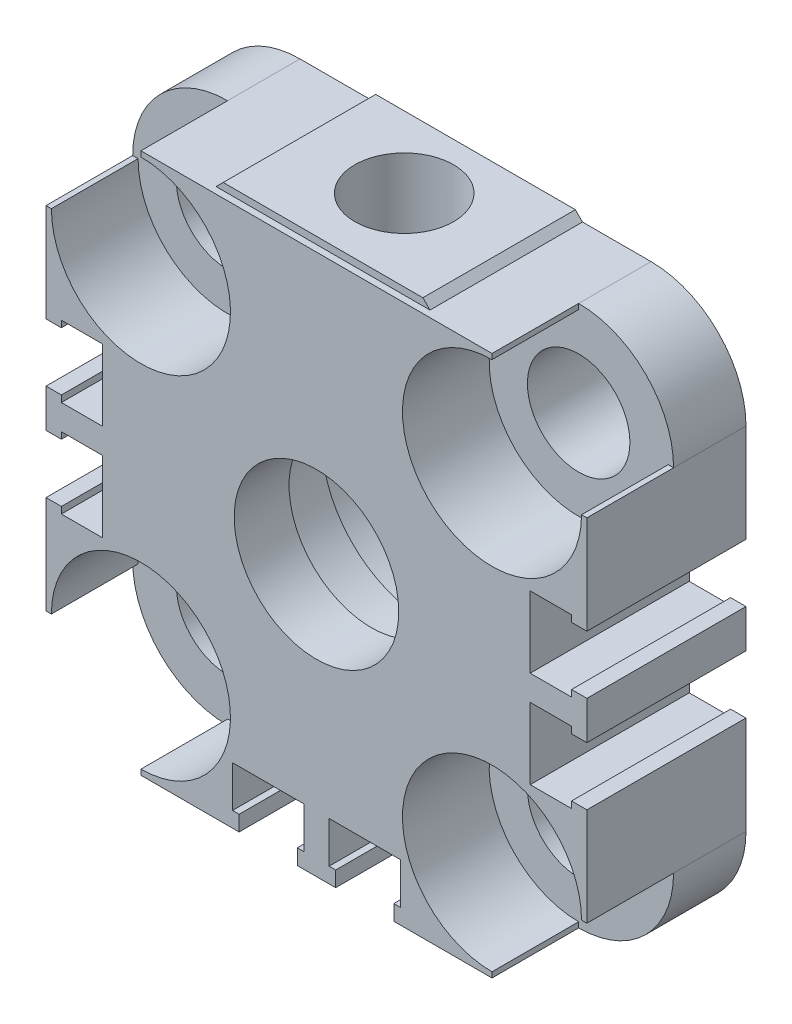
from build123d import *

# Parameters (mm, degrees)
EXTRUSION1_DEPTH                    = 14.5
ENL_V_MAT_EXTRU_1_DEPTH             = 7.9
ESQUISSE3_R                         = 4.67
ENL_V_MAT_EXTRU_2_DEPTH             = 7.9
R_P_TITION_CIRCULAIRE1_COUNT        = 4
ESQUISSE4_R                         = 7.5
ENL_V_MAT_EXTRU_3_DEPTH             = 38.755728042
ENL_V_MAT_EXTRU_4_DEPTH             = 38.755728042
R_P_TITION_CIRCULAIRE2_COUNT        = 3
R_P_TITION_CIRCULAIRE2_ANGLE        = 180
R_P_TITION_CIRCULAIRE2_COPY_1_DEPTH = 38.755728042
R_P_TITION_CIRCULAIRE2_COPY_2_DEPTH = 38.755728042
ESQUISSE7_W                         = 0.5
ESQUISSE7_H                         = 16
ESQUISSE9_W                         = 5
ESQUISSE9_H                         = 10.4
ESQUISSE9_W_2                       = 0.7
ESQUISSE9_H_2                       = 1.25
EXTRUSION2_DEPTH                    = 13.9
TROU_TARAUD_M10X1_01_D              = 9
TROU_TARAUD_M10X1_01_DEPTH          = 13
TROU_TARAUD_M10X1_01_TIP            = 2.703872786
ENL_V_MAT_EXTRU_5_REACH             = 40.183
ENL_V_MAT_EXTRU_5_END_RADIUS        = 4.5
ESQUISSE14_R                        = 0.85
ENL_V_MAT_EXTRU_5_DIRECTION_2_DEPTH = 39.183275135
ESQUISSE15_R                        = 9.5
ENL_V_MAT_EXTRU_6_DEPTH             = 10


with BuildPart() as part:
    # Esquisse1 → Extrusion1 (new body)
    with BuildSketch(Plane.XY):
        with BuildLine():
            Line((-16, 24.65), (16, 24.65))
            ThreePointArc((16, 24.65), (22.116473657, 22.116473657), (24.65, 16))
            Line((24.65, 16), (24.65, -16))
            ThreePointArc((24.65, -16), (22.116473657, -22.116473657), (16, -24.65))
            Line((16, -24.65), (-16, -24.65))
            ThreePointArc((-16, -24.65), (-22.116473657, -22.116473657), (-24.65, -16))
            Line((-24.65, -16), (-24.65, 16))
            ThreePointArc((-24.65, 16), (-22.116473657, 22.116473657), (-16, 24.65))
        make_face()
    extrude(amount=-EXTRUSION1_DEPTH)

    # Esquisse2 → Enl_v. mat.-Extru.1 (cut)
    with BuildSketch(Plane.XY):
        with BuildLine():
            Line((-16, 24.16), (-16, 24.65))
            ThreePointArc((-16, 24.65), (-22.116473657, 22.116473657), (-24.65, 16))
            Line((-24.65, 16), (-24.16, 16))
            ThreePointArc((-24.16, 16), (-10.230008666, 10.230008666), (-16, 24.16))
        make_face()
    enl_v_mat_extru_1 = extrude(amount=-ENL_V_MAT_EXTRU_1_DEPTH, mode=Mode.SUBTRACT)

    # Esquisse3 → Enl_v. mat.-Extru.2 (cut)
    with BuildSketch(Plane.XY.offset(-7.9)):
        with Locations((-16, 16)):
            Circle(ESQUISSE3_R)
    enl_v_mat_extru_2 = extrude(amount=-ENL_V_MAT_EXTRU_2_DEPTH, mode=Mode.SUBTRACT)

    # R_p_tition circulaire1: Enl_v. mat.-Extru.1, Enl_v. mat.-Extru.2 ×4 about axis
    r_p_tition_circulaire1_axis = Axis((0, 0, 0), (0, 0, 1))
    add([enl_v_mat_extru_1.rotate(r_p_tition_circulaire1_axis, i * 360 / R_P_TITION_CIRCULAIRE1_COUNT) for i in range(1, R_P_TITION_CIRCULAIRE1_COUNT)], mode=Mode.SUBTRACT)
    add([enl_v_mat_extru_2.rotate(r_p_tition_circulaire1_axis, i * 360 / R_P_TITION_CIRCULAIRE1_COUNT) for i in range(1, R_P_TITION_CIRCULAIRE1_COUNT)], mode=Mode.SUBTRACT)

    # Esquisse4 → Enl_v. mat.-Extru.3 (cut, through all)
    with BuildSketch(Plane.XY):
        Circle(ESQUISSE4_R)
    extrude(amount=-ENL_V_MAT_EXTRU_3_DEPTH, mode=Mode.SUBTRACT)

    # Esquisse6 → Enl_v. mat.-Extru.4 (cut, through all)
    with BuildSketch(Plane.XY):
        Polygon((-24.65, 7.05), (-23.25, 7.05), (-23.25, 7.65), (-19.48, 7.65), (-19.48, 1.15), (-23.25, 1.15), (-23.25, 1.75), (-24.65, 1.75), align=None)
    enl_v_mat_extru_4 = extrude(amount=-ENL_V_MAT_EXTRU_4_DEPTH, mode=Mode.SUBTRACT)

    # Sym_trie1: Enl_v. mat.-Extru.4 across plane
    add(enl_v_mat_extru_4.mirror(Plane.ZX), mode=Mode.SUBTRACT)

    # R_p_tition circulaire2: Enl_v. mat.-Extru.4 ×3 about axis
    r_p_tition_circulaire2_axis = Axis((0, 0, 0), (0, 0, 1))
    for i in range(1, R_P_TITION_CIRCULAIRE2_COUNT):
        add(enl_v_mat_extru_4.rotate(r_p_tition_circulaire2_axis, i * R_P_TITION_CIRCULAIRE2_ANGLE / (R_P_TITION_CIRCULAIRE2_COUNT - 1)), mode=Mode.SUBTRACT)

    # R_p_tition circulaire2 copy 1 sketch → R_p_tition circulaire2 copy 1 (cut, through all)
    with BuildSketch(Plane(origin=(0, 0, 0), x_dir=(0, 1, 0), z_dir=(0, 0, 1))):
        Polygon((-24.65, -7.05), (-23.25, -7.05), (-23.25, -7.65), (-19.48, -7.65), (-19.48, -1.15), (-23.25, -1.15), (-23.25, -1.75), (-24.65, -1.75), align=None)
    extrude(amount=-R_P_TITION_CIRCULAIRE2_COPY_1_DEPTH, mode=Mode.SUBTRACT)

    # R_p_tition circulaire2 copy 2 sketch → R_p_tition circulaire2 copy 2 (cut, through all)
    with BuildSketch(Plane(origin=(0, 0, 0), x_dir=(-1, 0, 0), z_dir=(0, 0, 1))):
        Polygon((-24.65, -7.05), (-23.25, -7.05), (-23.25, -7.65), (-19.48, -7.65), (-19.48, -1.15), (-23.25, -1.15), (-23.25, -1.75), (-24.65, -1.75), align=None)
    extrude(amount=-R_P_TITION_CIRCULAIRE2_COPY_2_DEPTH, mode=Mode.SUBTRACT)

    # Esquisse7 → R_volution1 (revolve)
    with BuildSketch(Plane(origin=(0, 0, 0), x_dir=(0, 0, -1), z_dir=(1, 0, 0)), mode=Mode.PRIVATE) as r_volution1_sk:
        with Locations((14.75, 8)):
            Rectangle(ESQUISSE7_W, ESQUISSE7_H)
    revolve(r_volution1_sk.sketch.rotate(Axis((0, 0, -26.289994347), (0, 0, -1)), 90), axis=Axis((0, 0, -26.289994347), (0, 0, -1)))

    # Esquisse9 → Enl_vement de mati_re-R_volution3 (revolve, cut)
    with BuildSketch(Plane(origin=(0, 0, 0), x_dir=(0, 0, -1), z_dir=(1, 0, 0)), mode=Mode.PRIVATE) as enl_vement_de_mati_re_r_volution3_sk:
        with Locations((12.5, 5.2)):
            Rectangle(ESQUISSE9_W, ESQUISSE9_H)
        with Locations((14.15, 16.625)):
            Rectangle(ESQUISSE9_W_2, ESQUISSE9_H_2)
    revolve(enl_vement_de_mati_re_r_volution3_sk.sketch.rotate(Axis((0, 0, -30.345608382), (0, 0, -1)), 90), axis=Axis((0, 0, -30.345608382), (0, 0, -1)), mode=Mode.SUBTRACT)

    # Esquisse10 → Extrusion2 (add)
    with BuildSketch(Plane(origin=(0, 0, -14.5), x_dir=(-1, 0, 0), z_dir=(0, 0, -1))):
        Polygon((-9.75, 24.65), (-9.1, 25.3), (9.1, 25.3), (9.75, 24.65), align=None)
    extrude(amount=-EXTRUSION2_DEPTH)

    # Trou taraud_ M10x1.01
    with Locations(Plane(origin=(0, 25.3, 0), x_dir=(-1, 0, 0), z_dir=(0, 1, 0))):
        with Locations((0, -8)):
            Hole(TROU_TARAUD_M10X1_01_D / 2, depth=TROU_TARAUD_M10X1_01_DEPTH)
            with Locations((0, 0, -(TROU_TARAUD_M10X1_01_DEPTH + TROU_TARAUD_M10X1_01_TIP / 2))):  # 118° drill point
                Cone(0, TROU_TARAUD_M10X1_01_D / 2, TROU_TARAUD_M10X1_01_TIP, mode=Mode.SUBTRACT)

    # Enl_v. mat.-Extru.5: up to this cylinder (the profile starts outside it)
    enl_v_mat_extru_5_end = Plane(origin=(0, 13.55, -8), z_dir=(0, 1, 0)) * Cylinder(ENL_V_MAT_EXTRU_5_END_RADIUS, 90.366, mode=Mode.PRIVATE)
    # Esquisse14 → Enl_v. mat.-Extru.5 (cut, up to the surface)
    with BuildSketch(Plane(origin=(0, 0, -14.5), x_dir=(-1, 0, 0), z_dir=(0, 0, -1)), mode=Mode.PRIVATE) as enl_v_mat_extru_5_sk1:
        with Locations((0, 13.55)):
            Circle(ESQUISSE14_R)
    enl_v_mat_extru_5_tool1 = extrude(enl_v_mat_extru_5_sk1.sketch, amount=-ENL_V_MAT_EXTRU_5_REACH, mode=Mode.PRIVATE) - enl_v_mat_extru_5_end
    add(enl_v_mat_extru_5_tool1.solids().sort_by_distance((0, 13.55, -14.5))[0], mode=Mode.SUBTRACT)

    # Esquisse14 → Enl_v. mat.-Extru.5 direction 2 (cut)
    with BuildSketch(Plane(origin=(0, 0, -14.5), x_dir=(-1, 0, 0), z_dir=(0, 0, -1))):
        with Locations((0, 13.55)):
            Circle(ESQUISSE14_R)
    extrude(amount=ENL_V_MAT_EXTRU_5_DIRECTION_2_DEPTH, mode=Mode.SUBTRACT)

    # Esquisse15 → Enl_v. mat.-Extru.6 (cut)
    with BuildSketch(Plane(origin=(0, 0, -15), x_dir=(-1, 0, 0), z_dir=(0, 0, -1))):
        Circle(ESQUISSE15_R)
    extrude(amount=-ENL_V_MAT_EXTRU_6_DEPTH, mode=Mode.SUBTRACT)


solid = part.part
